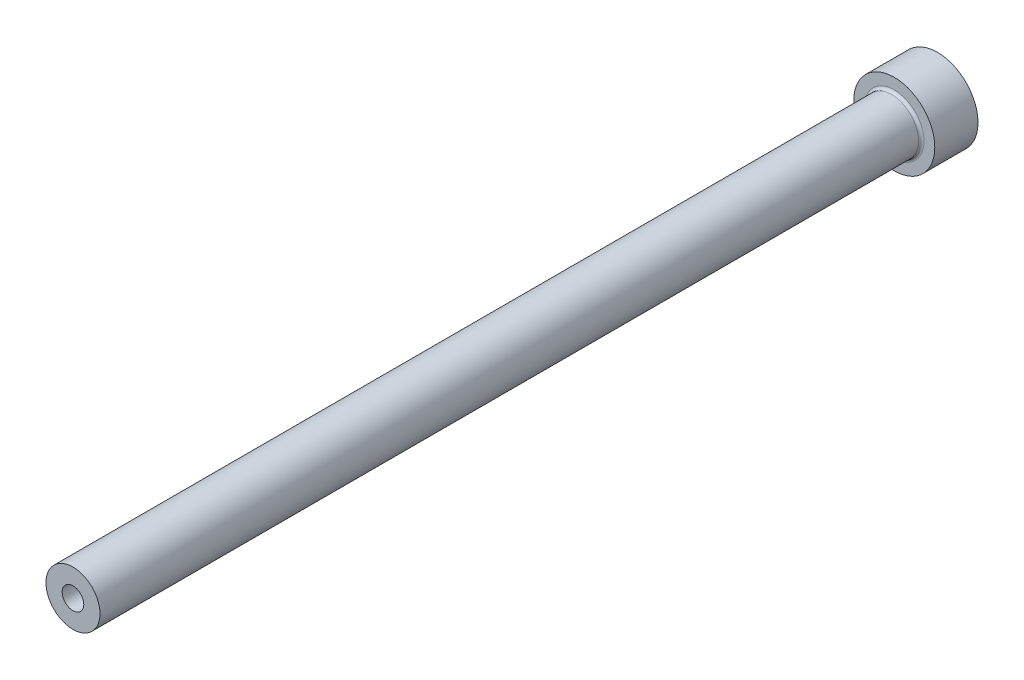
from build123d import *

# Parameters (mm, degrees)
HEAD_FILLET_R          = 0.5
ID_RELIEF_CHAMFER_SIZE = 0.5


with BuildPart() as part:
    # OD FV → Base Revolve (revolve)
    with BuildSketch(Plane(origin=(0, 0, 0), x_dir=(1, 0, 0), z_dir=(0, 1, 0))):
        Polygon((0, -160), (5, -160), (5, -8), (7.5, -8), (7.5, 0), (0, 0), align=None)
    revolve(axis=Axis((0, 0, 160), (0, 0, -1)))

    # ID FV → Hole (revolve, cut)
    with BuildSketch(Plane(origin=(0, 0, 0), x_dir=(1, 0, 0), z_dir=(0, 1, 0))):
        Polygon((0, -160), (2, -160), (2, -85), (2.25, -84.566987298), (2.25, 0), (0, 0), align=None)
    revolve(axis=Axis((0, 0, 160), (0, 0, -1)), mode=Mode.SUBTRACT)

    # Head Fillet
    head_fillet_edges = [part.edges().sort_by_distance(p)[0] for p in [
        (-5, 0, 8),
    ]]
    fillet(head_fillet_edges, radius=HEAD_FILLET_R)

    # ID Relief Chamfer
    id_relief_chamfer_edges = [part.edges().sort_by_distance(p)[0] for p in [
        (-2.25, 0, 0),
    ]]
    chamfer(id_relief_chamfer_edges, length=ID_RELIEF_CHAMFER_SIZE)


solid = part.part
